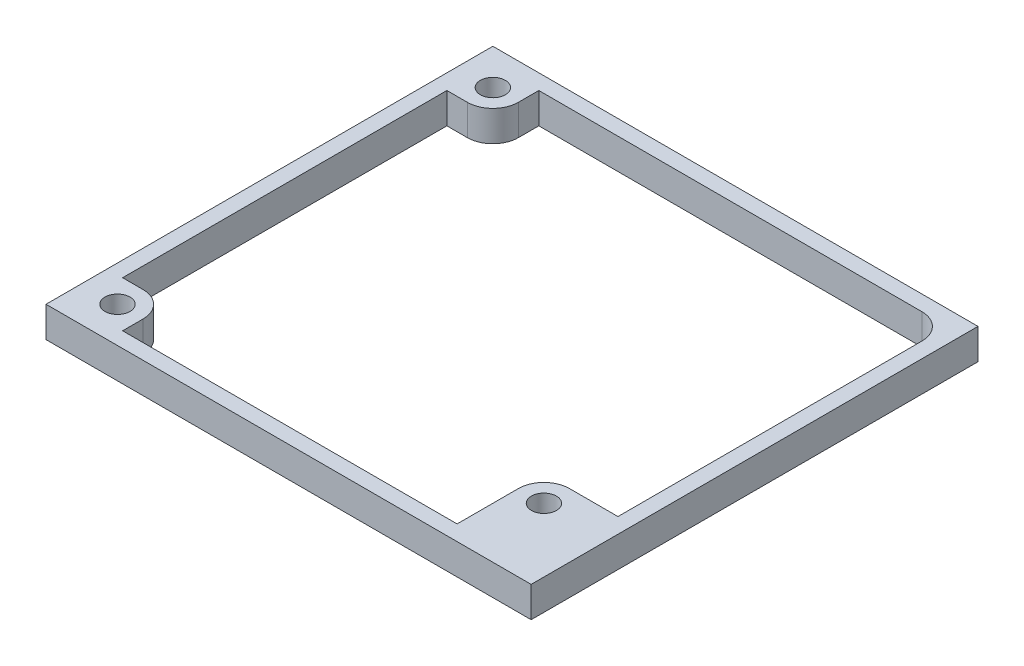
ISO-10303-21;
HEADER;
FILE_DESCRIPTION(('STEP AP214'),'2;1');
FILE_NAME('part.step','',(''),(''),'','','');
FILE_SCHEMA(('AUTOMOTIVE_DESIGN { 1 0 10303 214 1 1 1 1 }'));
ENDSEC;
DATA;
#1=APPLICATION_CONTEXT('core data for automotive mechanical design processes');
#2=APPLICATION_PROTOCOL_DEFINITION('international standard','automotive_design',2000,#1);
#3=PRODUCT_CONTEXT('',#1,'mechanical');
#4=PRODUCT('Part','Part','',(#3));
#5=PRODUCT_RELATED_PRODUCT_CATEGORY('part','',(#4));
#6=PRODUCT_DEFINITION_FORMATION('','',#4);
#7=PRODUCT_DEFINITION_CONTEXT('part definition',#1,'design');
#8=PRODUCT_DEFINITION('design','',#6,#7);
#9=PRODUCT_DEFINITION_SHAPE('','',#8);
#10=(LENGTH_UNIT() NAMED_UNIT(*) SI_UNIT(.MILLI.,.METRE.));
#11=(NAMED_UNIT(*) PLANE_ANGLE_UNIT() SI_UNIT($,.RADIAN.));
#12=(NAMED_UNIT(*) SI_UNIT($,.STERADIAN.) SOLID_ANGLE_UNIT());
#13=UNCERTAINTY_MEASURE_WITH_UNIT(LENGTH_MEASURE(1.E-05),#10,'distance_accuracy_value','');
#14=(GEOMETRIC_REPRESENTATION_CONTEXT(3) GLOBAL_UNCERTAINTY_ASSIGNED_CONTEXT((#13)) GLOBAL_UNIT_ASSIGNED_CONTEXT((#10,
#11,#12)) REPRESENTATION_CONTEXT('',''));
#15=CARTESIAN_POINT('',(0.,0.,0.));
#16=DIRECTION('',(0.,0.,1.));
#17=DIRECTION('',(1.,0.,0.));
#18=AXIS2_PLACEMENT_3D('',#15,#16,#17);
#19=CARTESIAN_POINT('',(45.974,3.048,-37.465));
#20=DIRECTION('',(0.,-1.,0.));
#21=DIRECTION('',(0.,0.,-1.));
#22=AXIS2_PLACEMENT_3D('',#19,#20,#21);
#23=CYLINDRICAL_SURFACE('',#22,2.54);
#24=DIRECTION('',(0.,1.,0.));
#25=VECTOR('',#24,1.);
#26=CARTESIAN_POINT('',(45.974,3.048,-40.005));
#27=LINE('',#26,#25);
#28=CARTESIAN_POINT('',(45.974,0.,-40.005));
#29=VERTEX_POINT('',#28);
#30=CARTESIAN_POINT('',(45.974,3.048,-40.005));
#31=VERTEX_POINT('',#30);
#32=EDGE_CURVE('E374',#29,#31,#27,.T.);
#33=ORIENTED_EDGE('',*,*,#32,.F.);
#34=CARTESIAN_POINT('',(45.974,0.,-37.465));
#35=DIRECTION('',(0.,-1.,0.));
#36=DIRECTION('',(0.,0.,-1.));
#37=AXIS2_PLACEMENT_3D('',#34,#35,#36);
#38=CIRCLE('',#37,2.54);
#39=CARTESIAN_POINT('',(48.514,0.,-37.465));
#40=VERTEX_POINT('',#39);
#41=EDGE_CURVE('E52',#29,#40,#38,.T.);
#42=ORIENTED_EDGE('',*,*,#41,.T.);
#43=DIRECTION('',(0.,1.,0.));
#44=VECTOR('',#43,1.);
#45=CARTESIAN_POINT('',(48.514,3.048,-37.465));
#46=LINE('',#45,#44);
#47=CARTESIAN_POINT('',(48.514,3.048,-37.465));
#48=VERTEX_POINT('',#47);
#49=EDGE_CURVE('E378',#48,#40,#46,.F.);
#50=ORIENTED_EDGE('',*,*,#49,.F.);
#51=CARTESIAN_POINT('',(45.974,3.048,-37.465));
#52=DIRECTION('',(0.,-1.,0.));
#53=DIRECTION('',(0.,0.,-1.));
#54=AXIS2_PLACEMENT_3D('',#51,#52,#53);
#55=CIRCLE('',#54,2.54);
#56=EDGE_CURVE('E11',#48,#31,#55,.F.);
#57=ORIENTED_EDGE('',*,*,#56,.T.);
#58=EDGE_LOOP('',(#33,#42,#50,#57));
#59=FACE_BOUND('',#58,.T.);
#60=ADVANCED_FACE('F44',(#59),#23,.F.);
#61=CARTESIAN_POINT('',(0.,3.048,0.));
#62=DIRECTION('',(0.,-1.,0.));
#63=DIRECTION('',(0.,0.,-1.));
#64=AXIS2_PLACEMENT_3D('',#61,#62,#63);
#65=PLANE('',#64);
#66=CARTESIAN_POINT('',(43.688,3.048,-4.699));
#67=DIRECTION('',(0.,1.,0.));
#68=DIRECTION('',(0.,0.,1.));
#69=AXIS2_PLACEMENT_3D('',#66,#67,#68);
#70=CIRCLE('',#69,1.2446);
#71=CARTESIAN_POINT('',(43.688,3.048,-5.9436));
#72=VERTEX_POINT('',#71);
#73=EDGE_CURVE('E309',#72,#72,#70,.T.);
#74=ORIENTED_EDGE('',*,*,#73,.F.);
#75=EDGE_LOOP('',(#74));
#76=FACE_BOUND('',#75,.T.);
#77=CARTESIAN_POINT('',(5.334,3.048,-37.973));
#78=DIRECTION('',(0.,1.,0.));
#79=DIRECTION('',(0.,0.,1.));
#80=AXIS2_PLACEMENT_3D('',#77,#78,#79);
#81=CIRCLE('',#80,1.2446);
#82=CARTESIAN_POINT('',(5.334,3.048,-39.2176));
#83=VERTEX_POINT('',#82);
#84=EDGE_CURVE('E317',#83,#83,#81,.T.);
#85=ORIENTED_EDGE('',*,*,#84,.F.);
#86=EDGE_LOOP('',(#85));
#87=FACE_BOUND('',#86,.T.);
#88=CARTESIAN_POINT('',(5.334,3.048,-0.634999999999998));
#89=DIRECTION('',(0.,1.,0.));
#90=DIRECTION('',(0.,0.,1.));
#91=AXIS2_PLACEMENT_3D('',#88,#89,#90);
#92=CIRCLE('',#91,1.2446);
#93=CARTESIAN_POINT('',(5.334,3.048,-1.8796));
#94=VERTEX_POINT('',#93);
#95=EDGE_CURVE('E325',#94,#94,#92,.T.);
#96=ORIENTED_EDGE('',*,*,#95,.F.);
#97=EDGE_LOOP('',(#96));
#98=FACE_BOUND('',#97,.T.);
#99=DIRECTION('',(0.,0.,1.));
#100=VECTOR('',#99,1.);
#101=CARTESIAN_POINT('',(1.778,3.048,2.921));
#102=LINE('',#101,#100);
#103=CARTESIAN_POINT('',(1.778,3.048,-41.529));
#104=VERTEX_POINT('',#103);
#105=CARTESIAN_POINT('',(1.778,3.048,2.921));
#106=VERTEX_POINT('',#105);
#107=EDGE_CURVE('E333',#104,#106,#102,.T.);
#108=ORIENTED_EDGE('',*,*,#107,.T.);
#109=DIRECTION('',(1.,0.,0.));
#110=VECTOR('',#109,1.);
#111=CARTESIAN_POINT('',(1.778,3.048,2.921));
#112=LINE('',#111,#110);
#113=CARTESIAN_POINT('',(50.038,3.048,2.921));
#114=VERTEX_POINT('',#113);
#115=EDGE_CURVE('E337',#106,#114,#112,.T.);
#116=ORIENTED_EDGE('',*,*,#115,.T.);
#117=DIRECTION('',(0.,0.,-1.));
#118=VECTOR('',#117,1.);
#119=CARTESIAN_POINT('',(50.038,3.048,2.921));
#120=LINE('',#119,#118);
#121=CARTESIAN_POINT('',(50.038,3.048,-41.529));
#122=VERTEX_POINT('',#121);
#123=EDGE_CURVE('E341',#114,#122,#120,.T.);
#124=ORIENTED_EDGE('',*,*,#123,.T.);
#125=DIRECTION('',(-1.,0.,0.));
#126=VECTOR('',#125,1.);
#127=CARTESIAN_POINT('',(1.778,3.048,-41.529));
#128=LINE('',#127,#126);
#129=EDGE_CURVE('E344',#122,#104,#128,.T.);
#130=ORIENTED_EDGE('',*,*,#129,.T.);
#131=EDGE_LOOP('',(#108,#116,#124,#130));
#132=FACE_BOUND('',#131,.T.);
#133=CARTESIAN_POINT('',(5.334,3.048,-37.973));
#134=DIRECTION('',(0.,-1.,0.));
#135=DIRECTION('',(0.,0.,1.));
#136=AXIS2_PLACEMENT_3D('',#133,#134,#135);
#137=CIRCLE('',#136,2.54);
#138=CARTESIAN_POINT('',(7.874,3.048,-37.973));
#139=VERTEX_POINT('',#138);
#140=CARTESIAN_POINT('',(5.334,3.048,-35.433));
#141=VERTEX_POINT('',#140);
#142=EDGE_CURVE('E168',#139,#141,#137,.T.);
#143=ORIENTED_EDGE('',*,*,#142,.F.);
#144=DIRECTION('',(0.,0.,1.));
#145=VECTOR('',#144,1.);
#146=CARTESIAN_POINT('',(7.874,3.048,-37.973));
#147=LINE('',#146,#145);
#148=CARTESIAN_POINT('',(7.874,3.048,-40.005));
#149=VERTEX_POINT('',#148);
#150=EDGE_CURVE('E227',#149,#139,#147,.T.);
#151=ORIENTED_EDGE('',*,*,#150,.F.);
#152=DIRECTION('',(-1.,0.,0.));
#153=VECTOR('',#152,1.);
#154=CARTESIAN_POINT('',(7.874,3.048,-40.005));
#155=LINE('',#154,#153);
#156=EDGE_CURVE('E224',#31,#149,#155,.T.);
#157=ORIENTED_EDGE('',*,*,#156,.F.);
#158=ORIENTED_EDGE('',*,*,#56,.F.);
#159=DIRECTION('',(0.,0.,-1.));
#160=VECTOR('',#159,1.);
#161=CARTESIAN_POINT('',(48.514,3.048,-7.239));
#162=LINE('',#161,#160);
#163=CARTESIAN_POINT('',(48.514,3.048,-7.239));
#164=VERTEX_POINT('',#163);
#165=EDGE_CURVE('E220',#164,#48,#162,.T.);
#166=ORIENTED_EDGE('',*,*,#165,.F.);
#167=DIRECTION('',(1.,0.,0.));
#168=VECTOR('',#167,1.);
#169=CARTESIAN_POINT('',(43.688,3.048,-7.239));
#170=LINE('',#169,#168);
#171=CARTESIAN_POINT('',(43.688,3.048,-7.239));
#172=VERTEX_POINT('',#171);
#173=EDGE_CURVE('E217',#172,#164,#170,.T.);
#174=ORIENTED_EDGE('',*,*,#173,.F.);
#175=CARTESIAN_POINT('',(43.688,3.048,-4.699));
#176=DIRECTION('',(0.,-1.,0.));
#177=DIRECTION('',(0.,0.,1.));
#178=AXIS2_PLACEMENT_3D('',#175,#176,#177);
#179=CIRCLE('',#178,2.54);
#180=CARTESIAN_POINT('',(41.148,3.048,-4.699));
#181=VERTEX_POINT('',#180);
#182=EDGE_CURVE('E214',#181,#172,#179,.T.);
#183=ORIENTED_EDGE('',*,*,#182,.F.);
#184=DIRECTION('',(0.,0.,-1.));
#185=VECTOR('',#184,1.);
#186=CARTESIAN_POINT('',(41.148,3.048,-4.699));
#187=LINE('',#186,#185);
#188=CARTESIAN_POINT('',(41.148,3.048,1.397));
#189=VERTEX_POINT('',#188);
#190=EDGE_CURVE('E211',#189,#181,#187,.T.);
#191=ORIENTED_EDGE('',*,*,#190,.F.);
#192=DIRECTION('',(1.,0.,0.));
#193=VECTOR('',#192,1.);
#194=CARTESIAN_POINT('',(7.874,3.048,1.397));
#195=LINE('',#194,#193);
#196=CARTESIAN_POINT('',(7.874,3.048,1.397));
#197=VERTEX_POINT('',#196);
#198=EDGE_CURVE('E208',#197,#189,#195,.T.);
#199=ORIENTED_EDGE('',*,*,#198,.F.);
#200=DIRECTION('',(0.,0.,1.));
#201=VECTOR('',#200,1.);
#202=CARTESIAN_POINT('',(7.874,3.048,-0.634999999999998));
#203=LINE('',#202,#201);
#204=CARTESIAN_POINT('',(7.874,3.048,-0.634999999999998));
#205=VERTEX_POINT('',#204);
#206=EDGE_CURVE('E205',#205,#197,#203,.T.);
#207=ORIENTED_EDGE('',*,*,#206,.F.);
#208=CARTESIAN_POINT('',(5.334,3.048,-0.634999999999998));
#209=DIRECTION('',(0.,-1.,0.));
#210=DIRECTION('',(0.,0.,1.));
#211=AXIS2_PLACEMENT_3D('',#208,#209,#210);
#212=CIRCLE('',#211,2.54);
#213=CARTESIAN_POINT('',(5.334,3.048,-3.175));
#214=VERTEX_POINT('',#213);
#215=EDGE_CURVE('E202',#214,#205,#212,.T.);
#216=ORIENTED_EDGE('',*,*,#215,.F.);
#217=DIRECTION('',(1.,0.,0.));
#218=VECTOR('',#217,1.);
#219=CARTESIAN_POINT('',(5.334,3.048,-3.175));
#220=LINE('',#219,#218);
#221=CARTESIAN_POINT('',(3.302,3.048,-3.175));
#222=VERTEX_POINT('',#221);
#223=EDGE_CURVE('E197',#222,#214,#220,.T.);
#224=ORIENTED_EDGE('',*,*,#223,.F.);
#225=DIRECTION('',(0.,0.,1.));
#226=VECTOR('',#225,1.);
#227=CARTESIAN_POINT('',(3.302,3.048,-3.175));
#228=LINE('',#227,#226);
#229=CARTESIAN_POINT('',(3.302,3.048,-35.433));
#230=VERTEX_POINT('',#229);
#231=EDGE_CURVE('E193',#230,#222,#228,.T.);
#232=ORIENTED_EDGE('',*,*,#231,.F.);
#233=DIRECTION('',(-1.,0.,0.));
#234=VECTOR('',#233,1.);
#235=CARTESIAN_POINT('',(5.334,3.048,-35.433));
#236=LINE('',#235,#234);
#237=EDGE_CURVE('E178',#141,#230,#236,.T.);
#238=ORIENTED_EDGE('',*,*,#237,.F.);
#239=EDGE_LOOP('',(#143,#151,#157,#158,#166,#174,#183,#191,#199,#207,#216,#224,#232,#238));
#240=FACE_BOUND('',#239,.T.);
#241=ADVANCED_FACE('F191',(#76,#87,#98,#132,#240),#65,.F.);
#242=CARTESIAN_POINT('',(0.,0.,0.));
#243=DIRECTION('',(0.,-1.,0.));
#244=DIRECTION('',(0.,0.,-1.));
#245=AXIS2_PLACEMENT_3D('',#242,#243,#244);
#246=PLANE('',#245);
#247=ORIENTED_EDGE('',*,*,#41,.F.);
#248=DIRECTION('',(-1.,0.,0.));
#249=VECTOR('',#248,1.);
#250=CARTESIAN_POINT('',(7.874,0.,-40.005));
#251=LINE('',#250,#249);
#252=CARTESIAN_POINT('',(7.874,0.,-40.005));
#253=VERTEX_POINT('',#252);
#254=EDGE_CURVE('E271',#29,#253,#251,.T.);
#255=ORIENTED_EDGE('',*,*,#254,.T.);
#256=DIRECTION('',(0.,0.,1.));
#257=VECTOR('',#256,1.);
#258=CARTESIAN_POINT('',(7.874,0.,-37.973));
#259=LINE('',#258,#257);
#260=CARTESIAN_POINT('',(7.874,0.,-37.973));
#261=VERTEX_POINT('',#260);
#262=EDGE_CURVE('E179',#253,#261,#259,.T.);
#263=ORIENTED_EDGE('',*,*,#262,.T.);
#264=CARTESIAN_POINT('',(5.334,0.,-37.973));
#265=DIRECTION('',(0.,-1.,0.));
#266=DIRECTION('',(0.,0.,1.));
#267=AXIS2_PLACEMENT_3D('',#264,#265,#266);
#268=CIRCLE('',#267,2.54);
#269=CARTESIAN_POINT('',(5.334,0.,-35.433));
#270=VERTEX_POINT('',#269);
#271=EDGE_CURVE('E230',#261,#270,#268,.T.);
#272=ORIENTED_EDGE('',*,*,#271,.T.);
#273=DIRECTION('',(-1.,0.,0.));
#274=VECTOR('',#273,1.);
#275=CARTESIAN_POINT('',(5.334,0.,-35.433));
#276=LINE('',#275,#274);
#277=CARTESIAN_POINT('',(3.302,0.,-35.433));
#278=VERTEX_POINT('',#277);
#279=EDGE_CURVE('E185',#270,#278,#276,.T.);
#280=ORIENTED_EDGE('',*,*,#279,.T.);
#281=DIRECTION('',(0.,0.,1.));
#282=VECTOR('',#281,1.);
#283=CARTESIAN_POINT('',(3.302,0.,-3.175));
#284=LINE('',#283,#282);
#285=CARTESIAN_POINT('',(3.302,0.,-3.175));
#286=VERTEX_POINT('',#285);
#287=EDGE_CURVE('E235',#278,#286,#284,.T.);
#288=ORIENTED_EDGE('',*,*,#287,.T.);
#289=DIRECTION('',(1.,0.,0.));
#290=VECTOR('',#289,1.);
#291=CARTESIAN_POINT('',(5.334,0.,-3.175));
#292=LINE('',#291,#290);
#293=CARTESIAN_POINT('',(5.334,0.,-3.175));
#294=VERTEX_POINT('',#293);
#295=EDGE_CURVE('E239',#286,#294,#292,.T.);
#296=ORIENTED_EDGE('',*,*,#295,.T.);
#297=CARTESIAN_POINT('',(5.334,0.,-0.634999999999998));
#298=DIRECTION('',(0.,-1.,0.));
#299=DIRECTION('',(0.,0.,1.));
#300=AXIS2_PLACEMENT_3D('',#297,#298,#299);
#301=CIRCLE('',#300,2.54);
#302=CARTESIAN_POINT('',(7.874,0.,-0.634999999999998));
#303=VERTEX_POINT('',#302);
#304=EDGE_CURVE('E243',#294,#303,#301,.T.);
#305=ORIENTED_EDGE('',*,*,#304,.T.);
#306=DIRECTION('',(0.,0.,1.));
#307=VECTOR('',#306,1.);
#308=CARTESIAN_POINT('',(7.874,0.,-0.634999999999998));
#309=LINE('',#308,#307);
#310=CARTESIAN_POINT('',(7.874,0.,1.397));
#311=VERTEX_POINT('',#310);
#312=EDGE_CURVE('E247',#303,#311,#309,.T.);
#313=ORIENTED_EDGE('',*,*,#312,.T.);
#314=DIRECTION('',(1.,0.,0.));
#315=VECTOR('',#314,1.);
#316=CARTESIAN_POINT('',(7.874,0.,1.397));
#317=LINE('',#316,#315);
#318=CARTESIAN_POINT('',(41.148,0.,1.397));
#319=VERTEX_POINT('',#318);
#320=EDGE_CURVE('E251',#311,#319,#317,.T.);
#321=ORIENTED_EDGE('',*,*,#320,.T.);
#322=DIRECTION('',(0.,0.,-1.));
#323=VECTOR('',#322,1.);
#324=CARTESIAN_POINT('',(41.148,0.,-4.699));
#325=LINE('',#324,#323);
#326=CARTESIAN_POINT('',(41.148,0.,-4.699));
#327=VERTEX_POINT('',#326);
#328=EDGE_CURVE('E255',#319,#327,#325,.T.);
#329=ORIENTED_EDGE('',*,*,#328,.T.);
#330=CARTESIAN_POINT('',(43.688,0.,-4.699));
#331=DIRECTION('',(0.,-1.,0.));
#332=DIRECTION('',(0.,0.,1.));
#333=AXIS2_PLACEMENT_3D('',#330,#331,#332);
#334=CIRCLE('',#333,2.54);
#335=CARTESIAN_POINT('',(43.688,0.,-7.239));
#336=VERTEX_POINT('',#335);
#337=EDGE_CURVE('E259',#327,#336,#334,.T.);
#338=ORIENTED_EDGE('',*,*,#337,.T.);
#339=DIRECTION('',(1.,0.,0.));
#340=VECTOR('',#339,1.);
#341=CARTESIAN_POINT('',(43.688,0.,-7.239));
#342=LINE('',#341,#340);
#343=CARTESIAN_POINT('',(48.514,0.,-7.239));
#344=VERTEX_POINT('',#343);
#345=EDGE_CURVE('E263',#336,#344,#342,.T.);
#346=ORIENTED_EDGE('',*,*,#345,.T.);
#347=DIRECTION('',(0.,0.,-1.));
#348=VECTOR('',#347,1.);
#349=CARTESIAN_POINT('',(48.514,0.,-7.239));
#350=LINE('',#349,#348);
#351=EDGE_CURVE('E267',#344,#40,#350,.T.);
#352=ORIENTED_EDGE('',*,*,#351,.T.);
#353=EDGE_LOOP('',(#247,#255,#263,#272,#280,#288,#296,#305,#313,#321,#329,#338,#346,#352));
#354=FACE_BOUND('',#353,.T.);
#355=CARTESIAN_POINT('',(5.334,0.,-37.973));
#356=DIRECTION('',(0.,1.,0.));
#357=DIRECTION('',(0.,0.,1.));
#358=AXIS2_PLACEMENT_3D('',#355,#356,#357);
#359=CIRCLE('',#358,1.2446);
#360=CARTESIAN_POINT('',(5.334,0.,-39.2176));
#361=VERTEX_POINT('',#360);
#362=EDGE_CURVE('E313',#361,#361,#359,.T.);
#363=ORIENTED_EDGE('',*,*,#362,.T.);
#364=EDGE_LOOP('',(#363));
#365=FACE_BOUND('',#364,.T.);
#366=DIRECTION('',(0.,0.,1.));
#367=VECTOR('',#366,1.);
#368=CARTESIAN_POINT('',(1.778,0.,2.921));
#369=LINE('',#368,#367);
#370=CARTESIAN_POINT('',(1.778,0.,-41.529));
#371=VERTEX_POINT('',#370);
#372=CARTESIAN_POINT('',(1.778,0.,2.921));
#373=VERTEX_POINT('',#372);
#374=EDGE_CURVE('E329',#371,#373,#369,.T.);
#375=ORIENTED_EDGE('',*,*,#374,.F.);
#376=DIRECTION('',(-1.,0.,0.));
#377=VECTOR('',#376,1.);
#378=CARTESIAN_POINT('',(1.778,0.,-41.529));
#379=LINE('',#378,#377);
#380=CARTESIAN_POINT('',(50.038,0.,-41.529));
#381=VERTEX_POINT('',#380);
#382=EDGE_CURVE('E338',#381,#371,#379,.T.);
#383=ORIENTED_EDGE('',*,*,#382,.F.);
#384=DIRECTION('',(0.,0.,-1.));
#385=VECTOR('',#384,1.);
#386=CARTESIAN_POINT('',(50.038,0.,2.921));
#387=LINE('',#386,#385);
#388=CARTESIAN_POINT('',(50.038,0.,2.921));
#389=VERTEX_POINT('',#388);
#390=EDGE_CURVE('E354',#389,#381,#387,.T.);
#391=ORIENTED_EDGE('',*,*,#390,.F.);
#392=DIRECTION('',(1.,0.,0.));
#393=VECTOR('',#392,1.);
#394=CARTESIAN_POINT('',(1.778,0.,2.921));
#395=LINE('',#394,#393);
#396=EDGE_CURVE('E351',#373,#389,#395,.T.);
#397=ORIENTED_EDGE('',*,*,#396,.F.);
#398=EDGE_LOOP('',(#375,#383,#391,#397));
#399=FACE_BOUND('',#398,.T.);
#400=CARTESIAN_POINT('',(5.334,0.,-0.634999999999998));
#401=DIRECTION('',(0.,1.,0.));
#402=DIRECTION('',(0.,0.,1.));
#403=AXIS2_PLACEMENT_3D('',#400,#401,#402);
#404=CIRCLE('',#403,1.2446);
#405=CARTESIAN_POINT('',(5.334,0.,-1.8796));
#406=VERTEX_POINT('',#405);
#407=EDGE_CURVE('E321',#406,#406,#404,.T.);
#408=ORIENTED_EDGE('',*,*,#407,.T.);
#409=EDGE_LOOP('',(#408));
#410=FACE_BOUND('',#409,.T.);
#411=CARTESIAN_POINT('',(43.688,0.,-4.699));
#412=DIRECTION('',(0.,1.,0.));
#413=DIRECTION('',(0.,0.,1.));
#414=AXIS2_PLACEMENT_3D('',#411,#412,#413);
#415=CIRCLE('',#414,1.2446);
#416=CARTESIAN_POINT('',(43.688,0.,-5.9436));
#417=VERTEX_POINT('',#416);
#418=EDGE_CURVE('E187',#417,#417,#415,.T.);
#419=ORIENTED_EDGE('',*,*,#418,.T.);
#420=EDGE_LOOP('',(#419));
#421=FACE_BOUND('',#420,.T.);
#422=ADVANCED_FACE('F386',(#354,#365,#399,#410,#421),#246,.T.);
#423=CARTESIAN_POINT('',(1.778,3.048,2.921));
#424=DIRECTION('',(1.,0.,0.));
#425=DIRECTION('',(0.,0.,-1.));
#426=AXIS2_PLACEMENT_3D('',#423,#424,#425);
#427=PLANE('',#426);
#428=ORIENTED_EDGE('',*,*,#374,.T.);
#429=DIRECTION('',(0.,-1.,0.));
#430=VECTOR('',#429,1.);
#431=CARTESIAN_POINT('',(1.778,3.048,2.921));
#432=LINE('',#431,#430);
#433=EDGE_CURVE('E370',#106,#373,#432,.T.);
#434=ORIENTED_EDGE('',*,*,#433,.F.);
#435=ORIENTED_EDGE('',*,*,#107,.F.);
#436=DIRECTION('',(0.,-1.,0.));
#437=VECTOR('',#436,1.);
#438=CARTESIAN_POINT('',(1.778,3.048,-41.529));
#439=LINE('',#438,#437);
#440=EDGE_CURVE('E347',#104,#371,#439,.T.);
#441=ORIENTED_EDGE('',*,*,#440,.T.);
#442=EDGE_LOOP('',(#428,#434,#435,#441));
#443=FACE_BOUND('',#442,.T.);
#444=ADVANCED_FACE('F442',(#443),#427,.F.);
#445=CARTESIAN_POINT('',(1.778,3.048,2.921));
#446=DIRECTION('',(0.,0.,-1.));
#447=DIRECTION('',(-1.,0.,0.));
#448=AXIS2_PLACEMENT_3D('',#445,#446,#447);
#449=PLANE('',#448);
#450=ORIENTED_EDGE('',*,*,#396,.T.);
#451=DIRECTION('',(0.,-1.,0.));
#452=VECTOR('',#451,1.);
#453=CARTESIAN_POINT('',(50.038,3.048,2.921));
#454=LINE('',#453,#452);
#455=EDGE_CURVE('E366',#114,#389,#454,.T.);
#456=ORIENTED_EDGE('',*,*,#455,.F.);
#457=ORIENTED_EDGE('',*,*,#115,.F.);
#458=ORIENTED_EDGE('',*,*,#433,.T.);
#459=EDGE_LOOP('',(#450,#456,#457,#458));
#460=FACE_BOUND('',#459,.T.);
#461=ADVANCED_FACE('F457',(#460),#449,.F.);
#462=CARTESIAN_POINT('',(50.038,3.048,2.921));
#463=DIRECTION('',(-1.,0.,0.));
#464=DIRECTION('',(0.,0.,1.));
#465=AXIS2_PLACEMENT_3D('',#462,#463,#464);
#466=PLANE('',#465);
#467=ORIENTED_EDGE('',*,*,#390,.T.);
#468=DIRECTION('',(0.,-1.,0.));
#469=VECTOR('',#468,1.);
#470=CARTESIAN_POINT('',(50.038,3.048,-41.529));
#471=LINE('',#470,#469);
#472=EDGE_CURVE('E362',#122,#381,#471,.T.);
#473=ORIENTED_EDGE('',*,*,#472,.F.);
#474=ORIENTED_EDGE('',*,*,#123,.F.);
#475=ORIENTED_EDGE('',*,*,#455,.T.);
#476=EDGE_LOOP('',(#467,#473,#474,#475));
#477=FACE_BOUND('',#476,.T.);
#478=ADVANCED_FACE('F453',(#477),#466,.F.);
#479=CARTESIAN_POINT('',(1.778,3.048,-41.529));
#480=DIRECTION('',(0.,0.,1.));
#481=DIRECTION('',(1.,0.,0.));
#482=AXIS2_PLACEMENT_3D('',#479,#480,#481);
#483=PLANE('',#482);
#484=ORIENTED_EDGE('',*,*,#382,.T.);
#485=ORIENTED_EDGE('',*,*,#440,.F.);
#486=ORIENTED_EDGE('',*,*,#129,.F.);
#487=ORIENTED_EDGE('',*,*,#472,.T.);
#488=EDGE_LOOP('',(#484,#485,#486,#487));
#489=FACE_BOUND('',#488,.T.);
#490=ADVANCED_FACE('F450',(#489),#483,.F.);
#491=CARTESIAN_POINT('',(5.334,3.048,-0.634999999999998));
#492=DIRECTION('',(0.,-1.,0.));
#493=DIRECTION('',(0.,0.,-1.));
#494=AXIS2_PLACEMENT_3D('',#491,#492,#493);
#495=CYLINDRICAL_SURFACE('',#494,1.2446);
#496=CARTESIAN_POINT('',(5.334,3.048,-1.8796));
#497=CARTESIAN_POINT('',(5.334,3.01625,-1.8796));
#498=CARTESIAN_POINT('',(5.334,2.9845,-1.8796));
#499=CARTESIAN_POINT('',(5.334,2.921,-1.8796));
#500=CARTESIAN_POINT('',(5.334,2.88925,-1.8796));
#501=CARTESIAN_POINT('',(5.334,2.82575,-1.8796));
#502=CARTESIAN_POINT('',(5.334,2.794,-1.8796));
#503=CARTESIAN_POINT('',(5.334,2.7305,-1.8796));
#504=CARTESIAN_POINT('',(5.334,2.69875,-1.8796));
#505=CARTESIAN_POINT('',(5.334,2.63525,-1.8796));
#506=CARTESIAN_POINT('',(5.334,2.6035,-1.8796));
#507=CARTESIAN_POINT('',(5.334,2.54,-1.8796));
#508=CARTESIAN_POINT('',(5.334,2.50825,-1.8796));
#509=CARTESIAN_POINT('',(5.334,2.44475,-1.8796));
#510=CARTESIAN_POINT('',(5.334,2.413,-1.8796));
#511=CARTESIAN_POINT('',(5.334,2.3495,-1.8796));
#512=CARTESIAN_POINT('',(5.334,2.31775,-1.8796));
#513=CARTESIAN_POINT('',(5.334,2.25425,-1.8796));
#514=CARTESIAN_POINT('',(5.334,2.2225,-1.8796));
#515=CARTESIAN_POINT('',(5.334,2.159,-1.8796));
#516=CARTESIAN_POINT('',(5.334,2.12725,-1.8796));
#517=CARTESIAN_POINT('',(5.334,2.06375,-1.8796));
#518=CARTESIAN_POINT('',(5.334,2.032,-1.8796));
#519=CARTESIAN_POINT('',(5.334,1.9685,-1.8796));
#520=CARTESIAN_POINT('',(5.334,1.93675,-1.8796));
#521=CARTESIAN_POINT('',(5.334,1.87325,-1.8796));
#522=CARTESIAN_POINT('',(5.334,1.8415,-1.8796));
#523=CARTESIAN_POINT('',(5.334,1.778,-1.8796));
#524=CARTESIAN_POINT('',(5.334,1.74625,-1.8796));
#525=CARTESIAN_POINT('',(5.334,1.68275,-1.8796));
#526=CARTESIAN_POINT('',(5.334,1.651,-1.8796));
#527=CARTESIAN_POINT('',(5.334,1.5875,-1.8796));
#528=CARTESIAN_POINT('',(5.334,1.55575,-1.8796));
#529=CARTESIAN_POINT('',(5.334,1.49225,-1.8796));
#530=CARTESIAN_POINT('',(5.334,1.4605,-1.8796));
#531=CARTESIAN_POINT('',(5.334,1.397,-1.8796));
#532=CARTESIAN_POINT('',(5.334,1.36525,-1.8796));
#533=CARTESIAN_POINT('',(5.334,1.30175,-1.8796));
#534=CARTESIAN_POINT('',(5.334,1.27,-1.8796));
#535=CARTESIAN_POINT('',(5.334,1.2065,-1.8796));
#536=CARTESIAN_POINT('',(5.334,1.17475,-1.8796));
#537=CARTESIAN_POINT('',(5.334,1.11125,-1.8796));
#538=CARTESIAN_POINT('',(5.334,1.0795,-1.8796));
#539=CARTESIAN_POINT('',(5.334,1.016,-1.8796));
#540=CARTESIAN_POINT('',(5.334,0.98425,-1.8796));
#541=CARTESIAN_POINT('',(5.334,0.92075,-1.8796));
#542=CARTESIAN_POINT('',(5.334,0.889,-1.8796));
#543=CARTESIAN_POINT('',(5.334,0.8255,-1.8796));
#544=CARTESIAN_POINT('',(5.334,0.79375,-1.8796));
#545=CARTESIAN_POINT('',(5.334,0.73025,-1.8796));
#546=CARTESIAN_POINT('',(5.334,0.6985,-1.8796));
#547=CARTESIAN_POINT('',(5.334,0.635,-1.8796));
#548=CARTESIAN_POINT('',(5.334,0.60325,-1.8796));
#549=CARTESIAN_POINT('',(5.334,0.53975,-1.8796));
#550=CARTESIAN_POINT('',(5.334,0.508,-1.8796));
#551=CARTESIAN_POINT('',(5.334,0.4445,-1.8796));
#552=CARTESIAN_POINT('',(5.334,0.41275,-1.8796));
#553=CARTESIAN_POINT('',(5.334,0.34925,-1.8796));
#554=CARTESIAN_POINT('',(5.334,0.3175,-1.8796));
#555=CARTESIAN_POINT('',(5.334,0.254,-1.8796));
#556=CARTESIAN_POINT('',(5.334,0.22225,-1.8796));
#557=CARTESIAN_POINT('',(5.334,0.15875,-1.8796));
#558=CARTESIAN_POINT('',(5.334,0.127,-1.8796));
#559=CARTESIAN_POINT('',(5.334,0.0634999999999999,-1.8796));
#560=CARTESIAN_POINT('',(5.334,0.03175,-1.8796));
#561=CARTESIAN_POINT('',(5.334,0.,-1.8796));
#562=B_SPLINE_CURVE_WITH_KNOTS('',3,(#496,#497,#498,#499,#500,#501,#502,#503,#504,#505,#506,
#507,#508,#509,#510,#511,#512,#513,#514,#515,#516,#517,#518,#519,#520,#521,#522,#523,#524,#525,
#526,#527,#528,#529,#530,#531,#532,#533,#534,#535,#536,#537,#538,#539,#540,#541,#542,#543,#544,
#545,#546,#547,#548,#549,#550,#551,#552,#553,#554,#555,#556,#557,#558,#559,#560,#561),
.UNSPECIFIED.,.F.,.F.,(4,2,2,2,2,2,2,2,2,2,2,2,2,2,2,2,2,2,2,2,2,2,2,2,2,2,2,2,2,2,2,2,4),(0.,
0.0952499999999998,0.1905,0.28575,0.381,0.47625,0.5715,0.66675,0.762,0.85725,0.9525,1.04775,
1.143,1.23825,1.3335,1.42875,1.524,1.61925,1.7145,1.80975,1.905,2.00025,2.0955,2.19075,2.286,
2.38125,2.4765,2.57175,2.667,2.76225,2.8575,2.95275,3.048),.UNSPECIFIED.);
#563=EDGE_CURVE('BSEAM447',#94,#406,#562,.T.);
#564=ORIENTED_EDGE('',*,*,#95,.T.);
#565=ORIENTED_EDGE('',*,*,#407,.F.);
#566=ORIENTED_EDGE('',*,*,#563,.T.);
#567=ORIENTED_EDGE('',*,*,#563,.F.);
#568=EDGE_LOOP('',(#564,#566,#565,#567));
#569=FACE_BOUND('',#568,.T.);
#570=ADVANCED_FACE('F447',(#569),#495,.F.);
#571=CARTESIAN_POINT('',(5.334,3.048,-37.973));
#572=DIRECTION('',(0.,-1.,0.));
#573=DIRECTION('',(0.,0.,-1.));
#574=AXIS2_PLACEMENT_3D('',#571,#572,#573);
#575=CYLINDRICAL_SURFACE('',#574,1.2446);
#576=CARTESIAN_POINT('',(5.334,3.048,-39.2176));
#577=CARTESIAN_POINT('',(5.334,3.01625,-39.2176));
#578=CARTESIAN_POINT('',(5.334,2.9845,-39.2176));
#579=CARTESIAN_POINT('',(5.334,2.921,-39.2176));
#580=CARTESIAN_POINT('',(5.334,2.88925,-39.2176));
#581=CARTESIAN_POINT('',(5.334,2.82575,-39.2176));
#582=CARTESIAN_POINT('',(5.334,2.794,-39.2176));
#583=CARTESIAN_POINT('',(5.334,2.7305,-39.2176));
#584=CARTESIAN_POINT('',(5.334,2.69875,-39.2176));
#585=CARTESIAN_POINT('',(5.334,2.63525,-39.2176));
#586=CARTESIAN_POINT('',(5.334,2.6035,-39.2176));
#587=CARTESIAN_POINT('',(5.334,2.54,-39.2176));
#588=CARTESIAN_POINT('',(5.334,2.50825,-39.2176));
#589=CARTESIAN_POINT('',(5.334,2.44475,-39.2176));
#590=CARTESIAN_POINT('',(5.334,2.413,-39.2176));
#591=CARTESIAN_POINT('',(5.334,2.3495,-39.2176));
#592=CARTESIAN_POINT('',(5.334,2.31775,-39.2176));
#593=CARTESIAN_POINT('',(5.334,2.25425,-39.2176));
#594=CARTESIAN_POINT('',(5.334,2.2225,-39.2176));
#595=CARTESIAN_POINT('',(5.334,2.159,-39.2176));
#596=CARTESIAN_POINT('',(5.334,2.12725,-39.2176));
#597=CARTESIAN_POINT('',(5.334,2.06375,-39.2176));
#598=CARTESIAN_POINT('',(5.334,2.032,-39.2176));
#599=CARTESIAN_POINT('',(5.334,1.9685,-39.2176));
#600=CARTESIAN_POINT('',(5.334,1.93675,-39.2176));
#601=CARTESIAN_POINT('',(5.334,1.87325,-39.2176));
#602=CARTESIAN_POINT('',(5.334,1.8415,-39.2176));
#603=CARTESIAN_POINT('',(5.334,1.778,-39.2176));
#604=CARTESIAN_POINT('',(5.334,1.74625,-39.2176));
#605=CARTESIAN_POINT('',(5.334,1.68275,-39.2176));
#606=CARTESIAN_POINT('',(5.334,1.651,-39.2176));
#607=CARTESIAN_POINT('',(5.334,1.5875,-39.2176));
#608=CARTESIAN_POINT('',(5.334,1.55575,-39.2176));
#609=CARTESIAN_POINT('',(5.334,1.49225,-39.2176));
#610=CARTESIAN_POINT('',(5.334,1.4605,-39.2176));
#611=CARTESIAN_POINT('',(5.334,1.397,-39.2176));
#612=CARTESIAN_POINT('',(5.334,1.36525,-39.2176));
#613=CARTESIAN_POINT('',(5.334,1.30175,-39.2176));
#614=CARTESIAN_POINT('',(5.334,1.27,-39.2176));
#615=CARTESIAN_POINT('',(5.334,1.2065,-39.2176));
#616=CARTESIAN_POINT('',(5.334,1.17475,-39.2176));
#617=CARTESIAN_POINT('',(5.334,1.11125,-39.2176));
#618=CARTESIAN_POINT('',(5.334,1.0795,-39.2176));
#619=CARTESIAN_POINT('',(5.334,1.016,-39.2176));
#620=CARTESIAN_POINT('',(5.334,0.98425,-39.2176));
#621=CARTESIAN_POINT('',(5.334,0.92075,-39.2176));
#622=CARTESIAN_POINT('',(5.334,0.889,-39.2176));
#623=CARTESIAN_POINT('',(5.334,0.8255,-39.2176));
#624=CARTESIAN_POINT('',(5.334,0.79375,-39.2176));
#625=CARTESIAN_POINT('',(5.334,0.73025,-39.2176));
#626=CARTESIAN_POINT('',(5.334,0.6985,-39.2176));
#627=CARTESIAN_POINT('',(5.334,0.635,-39.2176));
#628=CARTESIAN_POINT('',(5.334,0.60325,-39.2176));
#629=CARTESIAN_POINT('',(5.334,0.53975,-39.2176));
#630=CARTESIAN_POINT('',(5.334,0.508,-39.2176));
#631=CARTESIAN_POINT('',(5.334,0.4445,-39.2176));
#632=CARTESIAN_POINT('',(5.334,0.41275,-39.2176));
#633=CARTESIAN_POINT('',(5.334,0.34925,-39.2176));
#634=CARTESIAN_POINT('',(5.334,0.3175,-39.2176));
#635=CARTESIAN_POINT('',(5.334,0.254,-39.2176));
#636=CARTESIAN_POINT('',(5.334,0.22225,-39.2176));
#637=CARTESIAN_POINT('',(5.334,0.15875,-39.2176));
#638=CARTESIAN_POINT('',(5.334,0.127,-39.2176));
#639=CARTESIAN_POINT('',(5.334,0.0634999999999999,-39.2176));
#640=CARTESIAN_POINT('',(5.334,0.03175,-39.2176));
#641=CARTESIAN_POINT('',(5.334,0.,-39.2176));
#642=B_SPLINE_CURVE_WITH_KNOTS('',3,(#576,#577,#578,#579,#580,#581,#582,#583,#584,#585,#586,
#587,#588,#589,#590,#591,#592,#593,#594,#595,#596,#597,#598,#599,#600,#601,#602,#603,#604,#605,
#606,#607,#608,#609,#610,#611,#612,#613,#614,#615,#616,#617,#618,#619,#620,#621,#622,#623,#624,
#625,#626,#627,#628,#629,#630,#631,#632,#633,#634,#635,#636,#637,#638,#639,#640,#641),
.UNSPECIFIED.,.F.,.F.,(4,2,2,2,2,2,2,2,2,2,2,2,2,2,2,2,2,2,2,2,2,2,2,2,2,2,2,2,2,2,2,2,4),(0.,
0.0952499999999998,0.1905,0.28575,0.381,0.47625,0.5715,0.66675,0.762,0.85725,0.9525,1.04775,
1.143,1.23825,1.3335,1.42875,1.524,1.61925,1.7145,1.80975,1.905,2.00025,2.0955,2.19075,2.286,
2.38125,2.4765,2.57175,2.667,2.76225,2.8575,2.95275,3.048),.UNSPECIFIED.);
#643=EDGE_CURVE('BSEAM484',#83,#361,#642,.T.);
#644=ORIENTED_EDGE('',*,*,#84,.T.);
#645=ORIENTED_EDGE('',*,*,#362,.F.);
#646=ORIENTED_EDGE('',*,*,#643,.T.);
#647=ORIENTED_EDGE('',*,*,#643,.F.);
#648=EDGE_LOOP('',(#644,#646,#645,#647));
#649=FACE_BOUND('',#648,.T.);
#650=ADVANCED_FACE('F484',(#649),#575,.F.);
#651=CARTESIAN_POINT('',(43.688,3.048,-4.699));
#652=DIRECTION('',(0.,-1.,0.));
#653=DIRECTION('',(0.,0.,-1.));
#654=AXIS2_PLACEMENT_3D('',#651,#652,#653);
#655=CYLINDRICAL_SURFACE('',#654,1.2446);
#656=CARTESIAN_POINT('',(43.688,3.048,-5.9436));
#657=CARTESIAN_POINT('',(43.688,3.01625,-5.9436));
#658=CARTESIAN_POINT('',(43.688,2.9845,-5.9436));
#659=CARTESIAN_POINT('',(43.688,2.921,-5.9436));
#660=CARTESIAN_POINT('',(43.688,2.88925,-5.9436));
#661=CARTESIAN_POINT('',(43.688,2.82575,-5.9436));
#662=CARTESIAN_POINT('',(43.688,2.794,-5.9436));
#663=CARTESIAN_POINT('',(43.688,2.7305,-5.9436));
#664=CARTESIAN_POINT('',(43.688,2.69875,-5.9436));
#665=CARTESIAN_POINT('',(43.688,2.63525,-5.9436));
#666=CARTESIAN_POINT('',(43.688,2.6035,-5.9436));
#667=CARTESIAN_POINT('',(43.688,2.54,-5.9436));
#668=CARTESIAN_POINT('',(43.688,2.50825,-5.9436));
#669=CARTESIAN_POINT('',(43.688,2.44475,-5.9436));
#670=CARTESIAN_POINT('',(43.688,2.413,-5.9436));
#671=CARTESIAN_POINT('',(43.688,2.3495,-5.9436));
#672=CARTESIAN_POINT('',(43.688,2.31775,-5.9436));
#673=CARTESIAN_POINT('',(43.688,2.25425,-5.9436));
#674=CARTESIAN_POINT('',(43.688,2.2225,-5.9436));
#675=CARTESIAN_POINT('',(43.688,2.159,-5.9436));
#676=CARTESIAN_POINT('',(43.688,2.12725,-5.9436));
#677=CARTESIAN_POINT('',(43.688,2.06375,-5.9436));
#678=CARTESIAN_POINT('',(43.688,2.032,-5.9436));
#679=CARTESIAN_POINT('',(43.688,1.9685,-5.9436));
#680=CARTESIAN_POINT('',(43.688,1.93675,-5.9436));
#681=CARTESIAN_POINT('',(43.688,1.87325,-5.9436));
#682=CARTESIAN_POINT('',(43.688,1.8415,-5.9436));
#683=CARTESIAN_POINT('',(43.688,1.778,-5.9436));
#684=CARTESIAN_POINT('',(43.688,1.74625,-5.9436));
#685=CARTESIAN_POINT('',(43.688,1.68275,-5.9436));
#686=CARTESIAN_POINT('',(43.688,1.651,-5.9436));
#687=CARTESIAN_POINT('',(43.688,1.5875,-5.9436));
#688=CARTESIAN_POINT('',(43.688,1.55575,-5.9436));
#689=CARTESIAN_POINT('',(43.688,1.49225,-5.9436));
#690=CARTESIAN_POINT('',(43.688,1.4605,-5.9436));
#691=CARTESIAN_POINT('',(43.688,1.397,-5.9436));
#692=CARTESIAN_POINT('',(43.688,1.36525,-5.9436));
#693=CARTESIAN_POINT('',(43.688,1.30175,-5.9436));
#694=CARTESIAN_POINT('',(43.688,1.27,-5.9436));
#695=CARTESIAN_POINT('',(43.688,1.2065,-5.9436));
#696=CARTESIAN_POINT('',(43.688,1.17475,-5.9436));
#697=CARTESIAN_POINT('',(43.688,1.11125,-5.9436));
#698=CARTESIAN_POINT('',(43.688,1.0795,-5.9436));
#699=CARTESIAN_POINT('',(43.688,1.016,-5.9436));
#700=CARTESIAN_POINT('',(43.688,0.98425,-5.9436));
#701=CARTESIAN_POINT('',(43.688,0.92075,-5.9436));
#702=CARTESIAN_POINT('',(43.688,0.889,-5.9436));
#703=CARTESIAN_POINT('',(43.688,0.8255,-5.9436));
#704=CARTESIAN_POINT('',(43.688,0.79375,-5.9436));
#705=CARTESIAN_POINT('',(43.688,0.73025,-5.9436));
#706=CARTESIAN_POINT('',(43.688,0.6985,-5.9436));
#707=CARTESIAN_POINT('',(43.688,0.635,-5.9436));
#708=CARTESIAN_POINT('',(43.688,0.60325,-5.9436));
#709=CARTESIAN_POINT('',(43.688,0.53975,-5.9436));
#710=CARTESIAN_POINT('',(43.688,0.508,-5.9436));
#711=CARTESIAN_POINT('',(43.688,0.4445,-5.9436));
#712=CARTESIAN_POINT('',(43.688,0.41275,-5.9436));
#713=CARTESIAN_POINT('',(43.688,0.34925,-5.9436));
#714=CARTESIAN_POINT('',(43.688,0.3175,-5.9436));
#715=CARTESIAN_POINT('',(43.688,0.254,-5.9436));
#716=CARTESIAN_POINT('',(43.688,0.22225,-5.9436));
#717=CARTESIAN_POINT('',(43.688,0.15875,-5.9436));
#718=CARTESIAN_POINT('',(43.688,0.127,-5.9436));
#719=CARTESIAN_POINT('',(43.688,0.0634999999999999,-5.9436));
#720=CARTESIAN_POINT('',(43.688,0.03175,-5.9436));
#721=CARTESIAN_POINT('',(43.688,0.,-5.9436));
#722=B_SPLINE_CURVE_WITH_KNOTS('',3,(#656,#657,#658,#659,#660,#661,#662,#663,#664,#665,#666,
#667,#668,#669,#670,#671,#672,#673,#674,#675,#676,#677,#678,#679,#680,#681,#682,#683,#684,#685,
#686,#687,#688,#689,#690,#691,#692,#693,#694,#695,#696,#697,#698,#699,#700,#701,#702,#703,#704,
#705,#706,#707,#708,#709,#710,#711,#712,#713,#714,#715,#716,#717,#718,#719,#720,#721),
.UNSPECIFIED.,.F.,.F.,(4,2,2,2,2,2,2,2,2,2,2,2,2,2,2,2,2,2,2,2,2,2,2,2,2,2,2,2,2,2,2,2,4),(0.,
0.0952499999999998,0.1905,0.28575,0.381,0.47625,0.5715,0.66675,0.762,0.85725,0.9525,1.04775,
1.143,1.23825,1.3335,1.42875,1.524,1.61925,1.7145,1.80975,1.905,2.00025,2.0955,2.19075,2.286,
2.38125,2.4765,2.57175,2.667,2.76225,2.8575,2.95275,3.048),.UNSPECIFIED.);
#723=EDGE_CURVE('BSEAM482',#72,#417,#722,.T.);
#724=ORIENTED_EDGE('',*,*,#73,.T.);
#725=ORIENTED_EDGE('',*,*,#418,.F.);
#726=ORIENTED_EDGE('',*,*,#723,.T.);
#727=ORIENTED_EDGE('',*,*,#723,.F.);
#728=EDGE_LOOP('',(#724,#726,#725,#727));
#729=FACE_BOUND('',#728,.T.);
#730=ADVANCED_FACE('F482',(#729),#655,.F.);
#731=CARTESIAN_POINT('',(5.334,3.048,-37.973));
#732=DIRECTION('',(0.,-1.,0.));
#733=DIRECTION('',(0.,0.,-1.));
#734=AXIS2_PLACEMENT_3D('',#731,#732,#733);
#735=CYLINDRICAL_SURFACE('',#734,2.54);
#736=ORIENTED_EDGE('',*,*,#271,.F.);
#737=DIRECTION('',(0.,-1.,0.));
#738=VECTOR('',#737,1.);
#739=CARTESIAN_POINT('',(7.874,3.048,-37.973));
#740=LINE('',#739,#738);
#741=EDGE_CURVE('E174',#139,#261,#740,.T.);
#742=ORIENTED_EDGE('',*,*,#741,.F.);
#743=ORIENTED_EDGE('',*,*,#142,.T.);
#744=DIRECTION('',(0.,-1.,0.));
#745=VECTOR('',#744,1.);
#746=CARTESIAN_POINT('',(5.334,3.048,-35.433));
#747=LINE('',#746,#745);
#748=EDGE_CURVE('E171',#141,#270,#747,.T.);
#749=ORIENTED_EDGE('',*,*,#748,.T.);
#750=EDGE_LOOP('',(#736,#742,#743,#749));
#751=FACE_BOUND('',#750,.T.);
#752=ADVANCED_FACE('F170',(#751),#735,.T.);
#753=CARTESIAN_POINT('',(5.334,3.048,-35.433));
#754=DIRECTION('',(0.,0.,1.));
#755=DIRECTION('',(1.,0.,0.));
#756=AXIS2_PLACEMENT_3D('',#753,#754,#755);
#757=PLANE('',#756);
#758=ORIENTED_EDGE('',*,*,#279,.F.);
#759=ORIENTED_EDGE('',*,*,#748,.F.);
#760=ORIENTED_EDGE('',*,*,#237,.T.);
#761=DIRECTION('',(0.,-1.,0.));
#762=VECTOR('',#761,1.);
#763=CARTESIAN_POINT('',(3.302,3.048,-35.433));
#764=LINE('',#763,#762);
#765=EDGE_CURVE('E188',#230,#278,#764,.T.);
#766=ORIENTED_EDGE('',*,*,#765,.T.);
#767=EDGE_LOOP('',(#758,#759,#760,#766));
#768=FACE_BOUND('',#767,.T.);
#769=ADVANCED_FACE('F182',(#768),#757,.T.);
#770=CARTESIAN_POINT('',(3.302,3.048,-3.175));
#771=DIRECTION('',(1.,0.,0.));
#772=DIRECTION('',(0.,0.,-1.));
#773=AXIS2_PLACEMENT_3D('',#770,#771,#772);
#774=PLANE('',#773);
#775=ORIENTED_EDGE('',*,*,#287,.F.);
#776=ORIENTED_EDGE('',*,*,#765,.F.);
#777=ORIENTED_EDGE('',*,*,#231,.T.);
#778=DIRECTION('',(0.,-1.,0.));
#779=VECTOR('',#778,1.);
#780=CARTESIAN_POINT('',(3.302,3.048,-3.175));
#781=LINE('',#780,#779);
#782=EDGE_CURVE('E304',#222,#286,#781,.T.);
#783=ORIENTED_EDGE('',*,*,#782,.T.);
#784=EDGE_LOOP('',(#775,#776,#777,#783));
#785=FACE_BOUND('',#784,.T.);
#786=ADVANCED_FACE('F424',(#785),#774,.T.);
#787=CARTESIAN_POINT('',(5.334,3.048,-3.175));
#788=DIRECTION('',(0.,0.,-1.));
#789=DIRECTION('',(-1.,0.,0.));
#790=AXIS2_PLACEMENT_3D('',#787,#788,#789);
#791=PLANE('',#790);
#792=ORIENTED_EDGE('',*,*,#295,.F.);
#793=ORIENTED_EDGE('',*,*,#782,.F.);
#794=ORIENTED_EDGE('',*,*,#223,.T.);
#795=DIRECTION('',(0.,-1.,0.));
#796=VECTOR('',#795,1.);
#797=CARTESIAN_POINT('',(5.334,3.048,-3.175));
#798=LINE('',#797,#796);
#799=EDGE_CURVE('E301',#214,#294,#798,.T.);
#800=ORIENTED_EDGE('',*,*,#799,.T.);
#801=EDGE_LOOP('',(#792,#793,#794,#800));
#802=FACE_BOUND('',#801,.T.);
#803=ADVANCED_FACE('F420',(#802),#791,.T.);
#804=CARTESIAN_POINT('',(5.334,3.048,-0.634999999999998));
#805=DIRECTION('',(0.,-1.,0.));
#806=DIRECTION('',(0.,0.,-1.));
#807=AXIS2_PLACEMENT_3D('',#804,#805,#806);
#808=CYLINDRICAL_SURFACE('',#807,2.54);
#809=ORIENTED_EDGE('',*,*,#304,.F.);
#810=ORIENTED_EDGE('',*,*,#799,.F.);
#811=ORIENTED_EDGE('',*,*,#215,.T.);
#812=DIRECTION('',(0.,-1.,0.));
#813=VECTOR('',#812,1.);
#814=CARTESIAN_POINT('',(7.874,3.048,-0.634999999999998));
#815=LINE('',#814,#813);
#816=EDGE_CURVE('E298',#205,#303,#815,.T.);
#817=ORIENTED_EDGE('',*,*,#816,.T.);
#818=EDGE_LOOP('',(#809,#810,#811,#817));
#819=FACE_BOUND('',#818,.T.);
#820=ADVANCED_FACE('F416',(#819),#808,.T.);
#821=CARTESIAN_POINT('',(7.874,3.048,-0.634999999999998));
#822=DIRECTION('',(1.,0.,0.));
#823=DIRECTION('',(0.,0.,-1.));
#824=AXIS2_PLACEMENT_3D('',#821,#822,#823);
#825=PLANE('',#824);
#826=ORIENTED_EDGE('',*,*,#312,.F.);
#827=ORIENTED_EDGE('',*,*,#816,.F.);
#828=ORIENTED_EDGE('',*,*,#206,.T.);
#829=DIRECTION('',(0.,-1.,0.));
#830=VECTOR('',#829,1.);
#831=CARTESIAN_POINT('',(7.874,3.048,1.397));
#832=LINE('',#831,#830);
#833=EDGE_CURVE('E295',#197,#311,#832,.T.);
#834=ORIENTED_EDGE('',*,*,#833,.T.);
#835=EDGE_LOOP('',(#826,#827,#828,#834));
#836=FACE_BOUND('',#835,.T.);
#837=ADVANCED_FACE('F413',(#836),#825,.T.);
#838=CARTESIAN_POINT('',(7.874,3.048,1.397));
#839=DIRECTION('',(0.,0.,-1.));
#840=DIRECTION('',(-1.,0.,0.));
#841=AXIS2_PLACEMENT_3D('',#838,#839,#840);
#842=PLANE('',#841);
#843=ORIENTED_EDGE('',*,*,#320,.F.);
#844=ORIENTED_EDGE('',*,*,#833,.F.);
#845=ORIENTED_EDGE('',*,*,#198,.T.);
#846=DIRECTION('',(0.,-1.,0.));
#847=VECTOR('',#846,1.);
#848=CARTESIAN_POINT('',(41.148,3.048,1.397));
#849=LINE('',#848,#847);
#850=EDGE_CURVE('E292',#189,#319,#849,.T.);
#851=ORIENTED_EDGE('',*,*,#850,.T.);
#852=EDGE_LOOP('',(#843,#844,#845,#851));
#853=FACE_BOUND('',#852,.T.);
#854=ADVANCED_FACE('F406',(#853),#842,.T.);
#855=CARTESIAN_POINT('',(41.148,3.048,-4.699));
#856=DIRECTION('',(-1.,0.,0.));
#857=DIRECTION('',(0.,0.,1.));
#858=AXIS2_PLACEMENT_3D('',#855,#856,#857);
#859=PLANE('',#858);
#860=ORIENTED_EDGE('',*,*,#328,.F.);
#861=ORIENTED_EDGE('',*,*,#850,.F.);
#862=ORIENTED_EDGE('',*,*,#190,.T.);
#863=DIRECTION('',(0.,-1.,0.));
#864=VECTOR('',#863,1.);
#865=CARTESIAN_POINT('',(41.148,3.048,-4.699));
#866=LINE('',#865,#864);
#867=EDGE_CURVE('E289',#181,#327,#866,.T.);
#868=ORIENTED_EDGE('',*,*,#867,.T.);
#869=EDGE_LOOP('',(#860,#861,#862,#868));
#870=FACE_BOUND('',#869,.T.);
#871=ADVANCED_FACE('F402',(#870),#859,.T.);
#872=CARTESIAN_POINT('',(43.688,3.048,-4.699));
#873=DIRECTION('',(0.,-1.,0.));
#874=DIRECTION('',(0.,0.,-1.));
#875=AXIS2_PLACEMENT_3D('',#872,#873,#874);
#876=CYLINDRICAL_SURFACE('',#875,2.54);
#877=ORIENTED_EDGE('',*,*,#337,.F.);
#878=ORIENTED_EDGE('',*,*,#867,.F.);
#879=ORIENTED_EDGE('',*,*,#182,.T.);
#880=DIRECTION('',(0.,-1.,0.));
#881=VECTOR('',#880,1.);
#882=CARTESIAN_POINT('',(43.688,3.048,-7.239));
#883=LINE('',#882,#881);
#884=EDGE_CURVE('E286',#172,#336,#883,.T.);
#885=ORIENTED_EDGE('',*,*,#884,.T.);
#886=EDGE_LOOP('',(#877,#878,#879,#885));
#887=FACE_BOUND('',#886,.T.);
#888=ADVANCED_FACE('F399',(#887),#876,.T.);
#889=CARTESIAN_POINT('',(43.688,3.048,-7.239));
#890=DIRECTION('',(0.,0.,-1.));
#891=DIRECTION('',(-1.,0.,0.));
#892=AXIS2_PLACEMENT_3D('',#889,#890,#891);
#893=PLANE('',#892);
#894=ORIENTED_EDGE('',*,*,#345,.F.);
#895=ORIENTED_EDGE('',*,*,#884,.F.);
#896=ORIENTED_EDGE('',*,*,#173,.T.);
#897=DIRECTION('',(0.,-1.,0.));
#898=VECTOR('',#897,1.);
#899=CARTESIAN_POINT('',(48.514,3.048,-7.239));
#900=LINE('',#899,#898);
#901=EDGE_CURVE('E283',#164,#344,#900,.T.);
#902=ORIENTED_EDGE('',*,*,#901,.T.);
#903=EDGE_LOOP('',(#894,#895,#896,#902));
#904=FACE_BOUND('',#903,.T.);
#905=ADVANCED_FACE('F392',(#904),#893,.T.);
#906=CARTESIAN_POINT('',(48.514,3.048,-7.239));
#907=DIRECTION('',(-1.,0.,0.));
#908=DIRECTION('',(0.,0.,1.));
#909=AXIS2_PLACEMENT_3D('',#906,#907,#908);
#910=PLANE('',#909);
#911=ORIENTED_EDGE('',*,*,#165,.T.);
#912=ORIENTED_EDGE('',*,*,#49,.T.);
#913=ORIENTED_EDGE('',*,*,#351,.F.);
#914=ORIENTED_EDGE('',*,*,#901,.F.);
#915=EDGE_LOOP('',(#911,#912,#913,#914));
#916=FACE_BOUND('',#915,.T.);
#917=ADVANCED_FACE('F383',(#916),#910,.T.);
#918=CARTESIAN_POINT('',(7.874,3.048,-40.005));
#919=DIRECTION('',(0.,0.,1.));
#920=DIRECTION('',(1.,0.,0.));
#921=AXIS2_PLACEMENT_3D('',#918,#919,#920);
#922=PLANE('',#921);
#923=ORIENTED_EDGE('',*,*,#254,.F.);
#924=ORIENTED_EDGE('',*,*,#32,.T.);
#925=ORIENTED_EDGE('',*,*,#156,.T.);
#926=DIRECTION('',(0.,-1.,0.));
#927=VECTOR('',#926,1.);
#928=CARTESIAN_POINT('',(7.874,3.048,-40.005));
#929=LINE('',#928,#927);
#930=EDGE_CURVE('E279',#149,#253,#929,.T.);
#931=ORIENTED_EDGE('',*,*,#930,.T.);
#932=EDGE_LOOP('',(#923,#924,#925,#931));
#933=FACE_BOUND('',#932,.T.);
#934=ADVANCED_FACE('F431',(#933),#922,.T.);
#935=CARTESIAN_POINT('',(7.874,3.048,-37.973));
#936=DIRECTION('',(1.,0.,0.));
#937=DIRECTION('',(0.,0.,-1.));
#938=AXIS2_PLACEMENT_3D('',#935,#936,#937);
#939=PLANE('',#938);
#940=ORIENTED_EDGE('',*,*,#262,.F.);
#941=ORIENTED_EDGE('',*,*,#930,.F.);
#942=ORIENTED_EDGE('',*,*,#150,.T.);
#943=ORIENTED_EDGE('',*,*,#741,.T.);
#944=EDGE_LOOP('',(#940,#941,#942,#943));
#945=FACE_BOUND('',#944,.T.);
#946=ADVANCED_FACE('F427',(#945),#939,.T.);
#947=CLOSED_SHELL('',(#60,#241,#422,#444,#461,#478,#490,#570,#650,#730,#752,#769,#786,#803,#820,
#837,#854,#871,#888,#905,#917,#934,#946));
#948=MANIFOLD_SOLID_BREP('B2',#947);
#949=ADVANCED_BREP_SHAPE_REPRESENTATION('',(#18,#948),#14);
#950=SHAPE_DEFINITION_REPRESENTATION(#9,#949);
ENDSEC;
END-ISO-10303-21;
